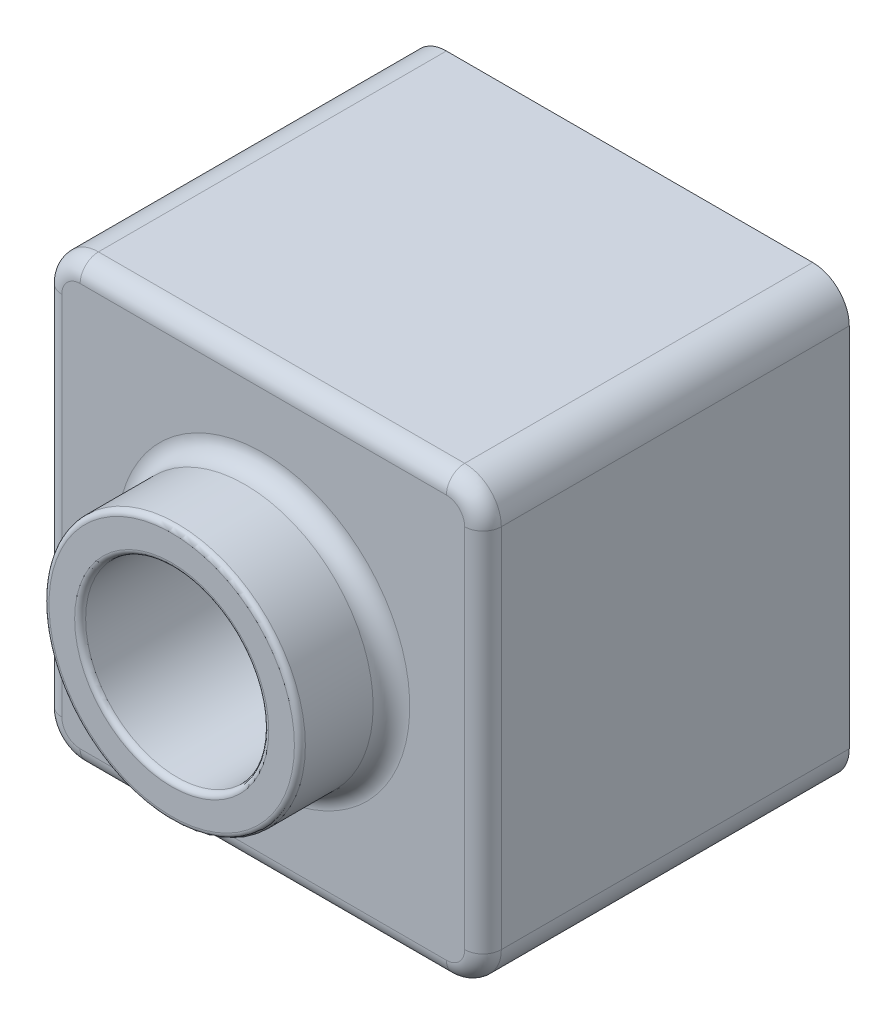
from build123d import *

# Parameters (mm, degrees)
SKETCH2_W           = 120
SKETCH2_H           = 120
BOSS_EXTRUDE1_DEPTH = 100
SKETCH4_R           = 35
BOSS_EXTRUDE2_DEPTH = 25
SKETCH6_R           = 25
CUT_EXTRUDE1_DEPTH  = 211.772389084
FILLET1_R           = 10
FILLET2_R           = 1.5
FILLET3_R           = 5
SHELL1_T            = -2


with BuildPart() as part:
    # Sketch2 → Boss-Extrude1 (new body)
    with BuildSketch(Plane.XY):
        with Locations((60, 60)):
            Rectangle(SKETCH2_W, SKETCH2_H)
    extrude(amount=BOSS_EXTRUDE1_DEPTH)

    # Sketch4 → Boss-Extrude2 (add)
    with BuildSketch(Plane.XY.offset(100)):
        with Locations(Location((60, 60, 0), (0, 0, 180))):
            Circle(SKETCH4_R)
    extrude(amount=BOSS_EXTRUDE2_DEPTH)

    # Sketch6 → Cut-Extrude1 (cut, through all)
    with BuildSketch(Plane.XY.offset(125)):
        with Locations((60, 60)):
            Circle(SKETCH6_R)
    extrude(amount=-CUT_EXTRUDE1_DEPTH, mode=Mode.SUBTRACT)

    # Fillet1
    fillet1_edges = [part.edges().sort_by_distance(p)[0] for p in [
        (0, 120, 50),
        (120, 120, 50),
        (120, 0, 50),
        (0, 0, 50),
    ]]
    fillet(fillet1_edges, radius=FILLET1_R)

    # Fillet2
    fillet2_edges = [part.edges().sort_by_distance(p)[0] for p in [
        (95, 60, 125),
        (35, 60, 125),
    ]]
    fillet(fillet2_edges, radius=FILLET2_R)

    # Fillet3
    fillet3_edges = [part.edges().sort_by_distance(p)[0] for p in [
        (95, 60, 100),
        (60, 0, 100),
        (0, 60, 100),
        (120, 60, 100),
        (60, 120, 100),
        (2.928932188, 117.071067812, 100),
        (117.071067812, 117.071067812, 100),
        (117.071067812, 2.928932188, 100),
        (2.928932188, 2.928932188, 100),
    ]]
    fillet(fillet3_edges, radius=FILLET3_R)

    # Shell1
    shell1_openings = [part.faces().sort_by_distance(p)[0] for p in [
        (60, 1.697056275, 0),
    ]]
    offset(amount=SHELL1_T, openings=shell1_openings, kind=Kind.INTERSECTION)


solid = part.part
